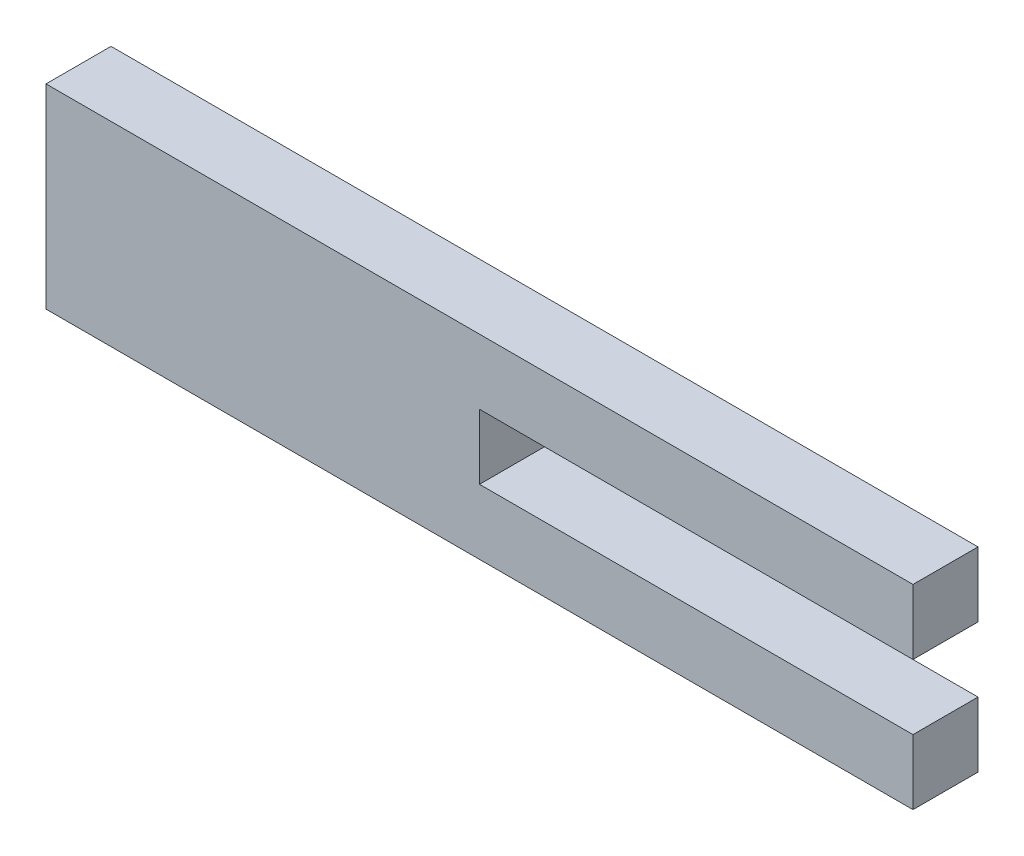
ISO-10303-21;
HEADER;
FILE_DESCRIPTION(('STEP AP214'),'2;1');
FILE_NAME('part.step','',(''),(''),'','','');
FILE_SCHEMA(('AUTOMOTIVE_DESIGN { 1 0 10303 214 1 1 1 1 }'));
ENDSEC;
DATA;
#1=APPLICATION_CONTEXT('core data for automotive mechanical design processes');
#2=APPLICATION_PROTOCOL_DEFINITION('international standard','automotive_design',2000,#1);
#3=PRODUCT_CONTEXT('',#1,'mechanical');
#4=PRODUCT('Part','Part','',(#3));
#5=PRODUCT_RELATED_PRODUCT_CATEGORY('part','',(#4));
#6=PRODUCT_DEFINITION_FORMATION('','',#4);
#7=PRODUCT_DEFINITION_CONTEXT('part definition',#1,'design');
#8=PRODUCT_DEFINITION('design','',#6,#7);
#9=PRODUCT_DEFINITION_SHAPE('','',#8);
#10=(LENGTH_UNIT() NAMED_UNIT(*) SI_UNIT(.MILLI.,.METRE.));
#11=(NAMED_UNIT(*) PLANE_ANGLE_UNIT() SI_UNIT($,.RADIAN.));
#12=(NAMED_UNIT(*) SI_UNIT($,.STERADIAN.) SOLID_ANGLE_UNIT());
#13=UNCERTAINTY_MEASURE_WITH_UNIT(LENGTH_MEASURE(1.E-05),#10,'distance_accuracy_value','');
#14=(GEOMETRIC_REPRESENTATION_CONTEXT(3) GLOBAL_UNCERTAINTY_ASSIGNED_CONTEXT((#13)) GLOBAL_UNIT_ASSIGNED_CONTEXT((#10,
#11,#12)) REPRESENTATION_CONTEXT('',''));
#15=CARTESIAN_POINT('',(0.,0.,0.));
#16=DIRECTION('',(0.,0.,1.));
#17=DIRECTION('',(1.,0.,0.));
#18=AXIS2_PLACEMENT_3D('',#15,#16,#17);
#19=CARTESIAN_POINT('',(20.,-4.5,3.));
#20=DIRECTION('',(-1.,0.,0.));
#21=DIRECTION('',(0.,0.,1.));
#22=AXIS2_PLACEMENT_3D('',#19,#20,#21);
#23=PLANE('',#22);
#24=DIRECTION('',(0.,1.,0.));
#25=VECTOR('',#24,1.);
#26=CARTESIAN_POINT('',(20.,-4.5,0.));
#27=LINE('',#26,#25);
#28=CARTESIAN_POINT('',(20.,-4.5,0.));
#29=VERTEX_POINT('',#28);
#30=CARTESIAN_POINT('',(20.,-1.5,0.));
#31=VERTEX_POINT('',#30);
#32=EDGE_CURVE('E128',#29,#31,#27,.T.);
#33=ORIENTED_EDGE('',*,*,#32,.T.);
#34=DIRECTION('',(0.,0.,1.));
#35=VECTOR('',#34,1.);
#36=CARTESIAN_POINT('',(20.,-1.5,-20.2237484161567));
#37=LINE('',#36,#35);
#38=CARTESIAN_POINT('',(20.,-1.5,3.));
#39=VERTEX_POINT('',#38);
#40=EDGE_CURVE('E113',#31,#39,#37,.T.);
#41=ORIENTED_EDGE('',*,*,#40,.T.);
#42=DIRECTION('',(0.,1.,0.));
#43=VECTOR('',#42,1.);
#44=CARTESIAN_POINT('',(20.,-4.5,3.));
#45=LINE('',#44,#43);
#46=CARTESIAN_POINT('',(20.,-4.5,3.));
#47=VERTEX_POINT('',#46);
#48=EDGE_CURVE('E126',#47,#39,#45,.T.);
#49=ORIENTED_EDGE('',*,*,#48,.F.);
#50=DIRECTION('',(0.,0.,-1.));
#51=VECTOR('',#50,1.);
#52=CARTESIAN_POINT('',(20.,-4.5,3.));
#53=LINE('',#52,#51);
#54=EDGE_CURVE('E45',#47,#29,#53,.T.);
#55=ORIENTED_EDGE('',*,*,#54,.T.);
#56=EDGE_LOOP('',(#33,#41,#49,#55));
#57=FACE_BOUND('',#56,.T.);
#58=ADVANCED_FACE('F37',(#57),#23,.F.);
#59=CARTESIAN_POINT('',(-20.,-4.5,3.));
#60=DIRECTION('',(1.,0.,0.));
#61=DIRECTION('',(0.,0.,-1.));
#62=AXIS2_PLACEMENT_3D('',#59,#60,#61);
#63=PLANE('',#62);
#64=DIRECTION('',(0.,-1.,0.));
#65=VECTOR('',#64,1.);
#66=CARTESIAN_POINT('',(-20.,-4.5,0.));
#67=LINE('',#66,#65);
#68=CARTESIAN_POINT('',(-20.,4.5,0.));
#69=VERTEX_POINT('',#68);
#70=CARTESIAN_POINT('',(-20.,-4.5,0.));
#71=VERTEX_POINT('',#70);
#72=EDGE_CURVE('E140',#69,#71,#67,.T.);
#73=ORIENTED_EDGE('',*,*,#72,.T.);
#74=DIRECTION('',(0.,0.,-1.));
#75=VECTOR('',#74,1.);
#76=CARTESIAN_POINT('',(-20.,-4.5,3.));
#77=LINE('',#76,#75);
#78=CARTESIAN_POINT('',(-20.,-4.5,3.));
#79=VERTEX_POINT('',#78);
#80=EDGE_CURVE('E11',#79,#71,#77,.T.);
#81=ORIENTED_EDGE('',*,*,#80,.F.);
#82=DIRECTION('',(0.,-1.,0.));
#83=VECTOR('',#82,1.);
#84=CARTESIAN_POINT('',(-20.,-4.5,3.));
#85=LINE('',#84,#83);
#86=CARTESIAN_POINT('',(-20.,4.5,3.));
#87=VERTEX_POINT('',#86);
#88=EDGE_CURVE('E149',#87,#79,#85,.T.);
#89=ORIENTED_EDGE('',*,*,#88,.F.);
#90=DIRECTION('',(0.,0.,-1.));
#91=VECTOR('',#90,1.);
#92=CARTESIAN_POINT('',(-20.,4.5,3.));
#93=LINE('',#92,#91);
#94=EDGE_CURVE('E135',#87,#69,#93,.T.);
#95=ORIENTED_EDGE('',*,*,#94,.T.);
#96=EDGE_LOOP('',(#73,#81,#89,#95));
#97=FACE_BOUND('',#96,.T.);
#98=ADVANCED_FACE('F39',(#97),#63,.F.);
#99=CARTESIAN_POINT('',(20.,-4.5,3.));
#100=DIRECTION('',(0.,1.,0.));
#101=DIRECTION('',(-1.,0.,0.));
#102=AXIS2_PLACEMENT_3D('',#99,#100,#101);
#103=PLANE('',#102);
#104=DIRECTION('',(1.,0.,0.));
#105=VECTOR('',#104,1.);
#106=CARTESIAN_POINT('',(20.,-4.5,0.));
#107=LINE('',#106,#105);
#108=EDGE_CURVE('E143',#71,#29,#107,.T.);
#109=ORIENTED_EDGE('',*,*,#108,.T.);
#110=ORIENTED_EDGE('',*,*,#54,.F.);
#111=DIRECTION('',(1.,0.,0.));
#112=VECTOR('',#111,1.);
#113=CARTESIAN_POINT('',(20.,-4.5,3.));
#114=LINE('',#113,#112);
#115=EDGE_CURVE('E89',#79,#47,#114,.T.);
#116=ORIENTED_EDGE('',*,*,#115,.F.);
#117=ORIENTED_EDGE('',*,*,#80,.T.);
#118=EDGE_LOOP('',(#109,#110,#116,#117));
#119=FACE_BOUND('',#118,.T.);
#120=ADVANCED_FACE('F170',(#119),#103,.F.);
#121=CARTESIAN_POINT('',(20.,1.5,3.));
#122=VERTEX_POINT('',#121);
#123=CARTESIAN_POINT('',(20.,4.5,3.));
#124=VERTEX_POINT('',#123);
#125=EDGE_CURVE('E133',#122,#124,#45,.T.);
#126=ORIENTED_EDGE('',*,*,#125,.F.);
#127=DIRECTION('',(0.,0.,1.));
#128=VECTOR('',#127,1.);
#129=CARTESIAN_POINT('',(20.,1.5,-20.2237484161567));
#130=LINE('',#129,#128);
#131=CARTESIAN_POINT('',(20.,1.5,0.));
#132=VERTEX_POINT('',#131);
#133=EDGE_CURVE('E129',#132,#122,#130,.T.);
#134=ORIENTED_EDGE('',*,*,#133,.F.);
#135=CARTESIAN_POINT('',(20.,4.5,0.));
#136=VERTEX_POINT('',#135);
#137=EDGE_CURVE('E146',#132,#136,#27,.T.);
#138=ORIENTED_EDGE('',*,*,#137,.T.);
#139=DIRECTION('',(0.,0.,-1.));
#140=VECTOR('',#139,1.);
#141=CARTESIAN_POINT('',(20.,4.5,3.));
#142=LINE('',#141,#140);
#143=EDGE_CURVE('E151',#124,#136,#142,.T.);
#144=ORIENTED_EDGE('',*,*,#143,.F.);
#145=EDGE_LOOP('',(#126,#134,#138,#144));
#146=FACE_BOUND('',#145,.T.);
#147=ADVANCED_FACE('F172',(#146),#23,.F.);
#148=CARTESIAN_POINT('',(20.,4.5,3.));
#149=DIRECTION('',(0.,-1.,0.));
#150=DIRECTION('',(1.,0.,0.));
#151=AXIS2_PLACEMENT_3D('',#148,#149,#150);
#152=PLANE('',#151);
#153=DIRECTION('',(-1.,0.,0.));
#154=VECTOR('',#153,1.);
#155=CARTESIAN_POINT('',(20.,4.5,0.));
#156=LINE('',#155,#154);
#157=EDGE_CURVE('E82',#136,#69,#156,.T.);
#158=ORIENTED_EDGE('',*,*,#157,.T.);
#159=ORIENTED_EDGE('',*,*,#94,.F.);
#160=DIRECTION('',(-1.,0.,0.));
#161=VECTOR('',#160,1.);
#162=CARTESIAN_POINT('',(20.,4.5,3.));
#163=LINE('',#162,#161);
#164=EDGE_CURVE('E61',#124,#87,#163,.T.);
#165=ORIENTED_EDGE('',*,*,#164,.F.);
#166=ORIENTED_EDGE('',*,*,#143,.T.);
#167=EDGE_LOOP('',(#158,#159,#165,#166));
#168=FACE_BOUND('',#167,.T.);
#169=ADVANCED_FACE('F177',(#168),#152,.F.);
#170=CARTESIAN_POINT('',(0.,0.,3.));
#171=DIRECTION('',(0.,0.,1.));
#172=DIRECTION('',(1.,0.,0.));
#173=AXIS2_PLACEMENT_3D('',#170,#171,#172);
#174=PLANE('',#173);
#175=DIRECTION('',(1.,0.,0.));
#176=VECTOR('',#175,1.);
#177=CARTESIAN_POINT('',(20.,-1.5,3.));
#178=LINE('',#177,#176);
#179=CARTESIAN_POINT('',(0.,-1.5,3.));
#180=VERTEX_POINT('',#179);
#181=EDGE_CURVE('E110',#180,#39,#178,.T.);
#182=ORIENTED_EDGE('',*,*,#181,.F.);
#183=DIRECTION('',(0.,-1.,0.));
#184=VECTOR('',#183,1.);
#185=CARTESIAN_POINT('',(0.,-1.5,3.));
#186=LINE('',#185,#184);
#187=CARTESIAN_POINT('',(0.,1.5,3.));
#188=VERTEX_POINT('',#187);
#189=EDGE_CURVE('E130',#188,#180,#186,.T.);
#190=ORIENTED_EDGE('',*,*,#189,.F.);
#191=DIRECTION('',(-1.,0.,0.));
#192=VECTOR('',#191,1.);
#193=CARTESIAN_POINT('',(20.,1.5,3.));
#194=LINE('',#193,#192);
#195=EDGE_CURVE('E120',#122,#188,#194,.T.);
#196=ORIENTED_EDGE('',*,*,#195,.F.);
#197=ORIENTED_EDGE('',*,*,#125,.T.);
#198=ORIENTED_EDGE('',*,*,#164,.T.);
#199=ORIENTED_EDGE('',*,*,#88,.T.);
#200=ORIENTED_EDGE('',*,*,#115,.T.);
#201=ORIENTED_EDGE('',*,*,#48,.T.);
#202=EDGE_LOOP('',(#182,#190,#196,#197,#198,#199,#200,#201));
#203=FACE_BOUND('',#202,.T.);
#204=ADVANCED_FACE('F132',(#203),#174,.T.);
#205=CARTESIAN_POINT('',(0.,0.,0.));
#206=DIRECTION('',(0.,0.,1.));
#207=DIRECTION('',(1.,0.,0.));
#208=AXIS2_PLACEMENT_3D('',#205,#206,#207);
#209=PLANE('',#208);
#210=DIRECTION('',(0.,1.,0.));
#211=VECTOR('',#210,1.);
#212=CARTESIAN_POINT('',(0.,-1.5,0.));
#213=LINE('',#212,#211);
#214=CARTESIAN_POINT('',(0.,-1.5,0.));
#215=VERTEX_POINT('',#214);
#216=CARTESIAN_POINT('',(0.,1.5,0.));
#217=VERTEX_POINT('',#216);
#218=EDGE_CURVE('E157',#215,#217,#213,.T.);
#219=ORIENTED_EDGE('',*,*,#218,.F.);
#220=DIRECTION('',(-1.,0.,0.));
#221=VECTOR('',#220,1.);
#222=CARTESIAN_POINT('',(20.,-1.5,0.));
#223=LINE('',#222,#221);
#224=EDGE_CURVE('E144',#31,#215,#223,.T.);
#225=ORIENTED_EDGE('',*,*,#224,.F.);
#226=ORIENTED_EDGE('',*,*,#32,.F.);
#227=ORIENTED_EDGE('',*,*,#108,.F.);
#228=ORIENTED_EDGE('',*,*,#72,.F.);
#229=ORIENTED_EDGE('',*,*,#157,.F.);
#230=ORIENTED_EDGE('',*,*,#137,.F.);
#231=DIRECTION('',(1.,0.,0.));
#232=VECTOR('',#231,1.);
#233=CARTESIAN_POINT('',(20.,1.5,0.));
#234=LINE('',#233,#232);
#235=EDGE_CURVE('E159',#217,#132,#234,.T.);
#236=ORIENTED_EDGE('',*,*,#235,.F.);
#237=EDGE_LOOP('',(#219,#225,#226,#227,#228,#229,#230,#236));
#238=FACE_BOUND('',#237,.T.);
#239=ADVANCED_FACE('F154',(#238),#209,.F.);
#240=CARTESIAN_POINT('',(20.,-1.5,-20.2237484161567));
#241=DIRECTION('',(0.,-1.,0.));
#242=DIRECTION('',(1.,0.,0.));
#243=AXIS2_PLACEMENT_3D('',#240,#241,#242);
#244=PLANE('',#243);
#245=ORIENTED_EDGE('',*,*,#224,.T.);
#246=DIRECTION('',(0.,0.,1.));
#247=VECTOR('',#246,1.);
#248=CARTESIAN_POINT('',(0.,-1.5,-20.2237484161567));
#249=LINE('',#248,#247);
#250=EDGE_CURVE('E116',#215,#180,#249,.T.);
#251=ORIENTED_EDGE('',*,*,#250,.T.);
#252=ORIENTED_EDGE('',*,*,#181,.T.);
#253=ORIENTED_EDGE('',*,*,#40,.F.);
#254=EDGE_LOOP('',(#245,#251,#252,#253));
#255=FACE_BOUND('',#254,.T.);
#256=ADVANCED_FACE('F112',(#255),#244,.F.);
#257=CARTESIAN_POINT('',(0.,-1.5,-20.2237484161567));
#258=DIRECTION('',(-1.,0.,0.));
#259=DIRECTION('',(0.,-1.,0.));
#260=AXIS2_PLACEMENT_3D('',#257,#258,#259);
#261=PLANE('',#260);
#262=ORIENTED_EDGE('',*,*,#218,.T.);
#263=DIRECTION('',(0.,0.,1.));
#264=VECTOR('',#263,1.);
#265=CARTESIAN_POINT('',(0.,1.5,-20.2237484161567));
#266=LINE('',#265,#264);
#267=EDGE_CURVE('E52',#217,#188,#266,.T.);
#268=ORIENTED_EDGE('',*,*,#267,.T.);
#269=ORIENTED_EDGE('',*,*,#189,.T.);
#270=ORIENTED_EDGE('',*,*,#250,.F.);
#271=EDGE_LOOP('',(#262,#268,#269,#270));
#272=FACE_BOUND('',#271,.T.);
#273=ADVANCED_FACE('F192',(#272),#261,.F.);
#274=CARTESIAN_POINT('',(20.,1.5,-20.2237484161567));
#275=DIRECTION('',(0.,1.,0.));
#276=DIRECTION('',(-1.,0.,0.));
#277=AXIS2_PLACEMENT_3D('',#274,#275,#276);
#278=PLANE('',#277);
#279=ORIENTED_EDGE('',*,*,#235,.T.);
#280=ORIENTED_EDGE('',*,*,#133,.T.);
#281=ORIENTED_EDGE('',*,*,#195,.T.);
#282=ORIENTED_EDGE('',*,*,#267,.F.);
#283=EDGE_LOOP('',(#279,#280,#281,#282));
#284=FACE_BOUND('',#283,.T.);
#285=ADVANCED_FACE('F193',(#284),#278,.F.);
#286=CLOSED_SHELL('',(#58,#98,#120,#147,#169,#204,#239,#256,#273,#285));
#287=MANIFOLD_SOLID_BREP('B2',#286);
#288=ADVANCED_BREP_SHAPE_REPRESENTATION('',(#18,#287),#14);
#289=SHAPE_DEFINITION_REPRESENTATION(#9,#288);
ENDSEC;
END-ISO-10303-21;
